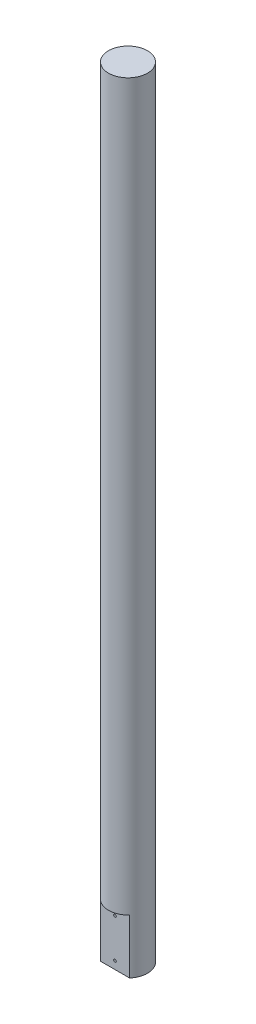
ISO-10303-21;
HEADER;
FILE_DESCRIPTION(('STEP AP214'),'2;1');
FILE_NAME('part.step','',(''),(''),'','','');
FILE_SCHEMA(('AUTOMOTIVE_DESIGN { 1 0 10303 214 1 1 1 1 }'));
ENDSEC;
DATA;
#1=APPLICATION_CONTEXT('core data for automotive mechanical design processes');
#2=APPLICATION_PROTOCOL_DEFINITION('international standard','automotive_design',2000,#1);
#3=PRODUCT_CONTEXT('',#1,'mechanical');
#4=PRODUCT('Part','Part','',(#3));
#5=PRODUCT_RELATED_PRODUCT_CATEGORY('part','',(#4));
#6=PRODUCT_DEFINITION_FORMATION('','',#4);
#7=PRODUCT_DEFINITION_CONTEXT('part definition',#1,'design');
#8=PRODUCT_DEFINITION('design','',#6,#7);
#9=PRODUCT_DEFINITION_SHAPE('','',#8);
#10=(LENGTH_UNIT() NAMED_UNIT(*) SI_UNIT(.MILLI.,.METRE.));
#11=(NAMED_UNIT(*) PLANE_ANGLE_UNIT() SI_UNIT($,.RADIAN.));
#12=(NAMED_UNIT(*) SI_UNIT($,.STERADIAN.) SOLID_ANGLE_UNIT());
#13=UNCERTAINTY_MEASURE_WITH_UNIT(LENGTH_MEASURE(1.E-05),#10,'distance_accuracy_value','');
#14=(GEOMETRIC_REPRESENTATION_CONTEXT(3) GLOBAL_UNCERTAINTY_ASSIGNED_CONTEXT((#13)) GLOBAL_UNIT_ASSIGNED_CONTEXT((#10,
#11,#12)) REPRESENTATION_CONTEXT('',''));
#15=CARTESIAN_POINT('',(0.,0.,0.));
#16=DIRECTION('',(0.,0.,1.));
#17=DIRECTION('',(1.,0.,0.));
#18=AXIS2_PLACEMENT_3D('',#15,#16,#17);
#19=CARTESIAN_POINT('',(0.,300.,0.));
#20=DIRECTION('',(0.,-1.,0.));
#21=DIRECTION('',(0.,0.,-1.));
#22=AXIS2_PLACEMENT_3D('',#19,#20,#21);
#23=CYLINDRICAL_SURFACE('',#22,7.5);
#24=CARTESIAN_POINT('',(0.,300.,0.));
#25=DIRECTION('',(0.,1.,0.));
#26=DIRECTION('',(0.,0.,1.));
#27=AXIS2_PLACEMENT_3D('',#24,#25,#26);
#28=CIRCLE('',#27,7.5);
#29=CARTESIAN_POINT('',(0.,300.,7.5));
#30=VERTEX_POINT('',#29);
#31=EDGE_CURVE('E66',#30,#30,#28,.T.);
#32=ORIENTED_EDGE('',*,*,#31,.F.);
#33=EDGE_LOOP('',(#32));
#34=FACE_BOUND('',#33,.T.);
#35=CARTESIAN_POINT('',(0.,21.,0.));
#36=DIRECTION('',(0.,1.,0.));
#37=DIRECTION('',(0.,0.,1.));
#38=AXIS2_PLACEMENT_3D('',#35,#36,#37);
#39=CIRCLE('',#38,7.5);
#40=CARTESIAN_POINT('',(-5.59016994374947,21.,5.));
#41=VERTEX_POINT('',#40);
#42=CARTESIAN_POINT('',(5.59016994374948,21.,5.));
#43=VERTEX_POINT('',#42);
#44=EDGE_CURVE('E11',#41,#43,#39,.T.);
#45=ORIENTED_EDGE('',*,*,#44,.T.);
#46=DIRECTION('',(0.,-1.,0.));
#47=VECTOR('',#46,1.);
#48=CARTESIAN_POINT('',(5.59016994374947,300.,5.));
#49=LINE('',#48,#47);
#50=CARTESIAN_POINT('',(5.59016994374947,0.,5.));
#51=VERTEX_POINT('',#50);
#52=EDGE_CURVE('E55',#43,#51,#49,.T.);
#53=ORIENTED_EDGE('',*,*,#52,.T.);
#54=CARTESIAN_POINT('',(0.,0.,0.));
#55=DIRECTION('',(0.,1.,0.));
#56=DIRECTION('',(0.,0.,1.));
#57=AXIS2_PLACEMENT_3D('',#54,#55,#56);
#58=CIRCLE('',#57,7.5);
#59=CARTESIAN_POINT('',(-5.59016994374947,0.,5.));
#60=VERTEX_POINT('',#59);
#61=EDGE_CURVE('E60',#51,#60,#58,.T.);
#62=ORIENTED_EDGE('',*,*,#61,.T.);
#63=DIRECTION('',(0.,-1.,0.));
#64=VECTOR('',#63,1.);
#65=CARTESIAN_POINT('',(-5.59016994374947,300.,5.));
#66=LINE('',#65,#64);
#67=EDGE_CURVE('E40',#60,#41,#66,.F.);
#68=ORIENTED_EDGE('',*,*,#67,.T.);
#69=EDGE_LOOP('',(#45,#53,#62,#68));
#70=FACE_BOUND('',#69,.T.);
#71=ADVANCED_FACE('F26',(#34,#70),#23,.T.);
#72=CARTESIAN_POINT('',(0.,300.,0.));
#73=DIRECTION('',(0.,1.,0.));
#74=DIRECTION('',(0.,0.,1.));
#75=AXIS2_PLACEMENT_3D('',#72,#73,#74);
#76=PLANE('',#75);
#77=ORIENTED_EDGE('',*,*,#31,.T.);
#78=EDGE_LOOP('',(#77));
#79=FACE_BOUND('',#78,.T.);
#80=ADVANCED_FACE('F71',(#79),#76,.T.);
#81=CARTESIAN_POINT('',(0.,0.,0.));
#82=DIRECTION('',(0.,1.,0.));
#83=DIRECTION('',(0.,0.,1.));
#84=AXIS2_PLACEMENT_3D('',#81,#82,#83);
#85=PLANE('',#84);
#86=ORIENTED_EDGE('',*,*,#61,.F.);
#87=DIRECTION('',(-1.,0.,0.));
#88=VECTOR('',#87,1.);
#89=CARTESIAN_POINT('',(0.,0.,5.));
#90=LINE('',#89,#88);
#91=EDGE_CURVE('E33',#51,#60,#90,.T.);
#92=ORIENTED_EDGE('',*,*,#91,.T.);
#93=EDGE_LOOP('',(#86,#92));
#94=FACE_BOUND('',#93,.T.);
#95=ADVANCED_FACE('F69',(#94),#85,.F.);
#96=CARTESIAN_POINT('',(-10.,21.,8.22039462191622));
#97=DIRECTION('',(0.,1.,0.));
#98=DIRECTION('',(0.,0.,1.));
#99=AXIS2_PLACEMENT_3D('',#96,#97,#98);
#100=PLANE('',#99);
#101=DIRECTION('',(1.,0.,0.));
#102=VECTOR('',#101,1.);
#103=CARTESIAN_POINT('',(-10.,21.,5.));
#104=LINE('',#103,#102);
#105=EDGE_CURVE('E52',#41,#43,#104,.T.);
#106=ORIENTED_EDGE('',*,*,#105,.T.);
#107=ORIENTED_EDGE('',*,*,#44,.F.);
#108=EDGE_LOOP('',(#106,#107));
#109=FACE_BOUND('',#108,.T.);
#110=ADVANCED_FACE('F51',(#109),#100,.F.);
#111=CARTESIAN_POINT('',(-10.,21.,5.));
#112=DIRECTION('',(0.,0.,-1.));
#113=DIRECTION('',(-1.,0.,0.));
#114=AXIS2_PLACEMENT_3D('',#111,#112,#113);
#115=PLANE('',#114);
#116=CARTESIAN_POINT('',(0.,18.,5.));
#117=DIRECTION('',(0.,0.,1.));
#118=DIRECTION('',(1.,0.,0.));
#119=AXIS2_PLACEMENT_3D('',#116,#117,#118);
#120=CIRCLE('',#119,0.5);
#121=CARTESIAN_POINT('',(0.5,18.,5.));
#122=VERTEX_POINT('',#121);
#123=EDGE_CURVE('E139',#122,#122,#120,.T.);
#124=ORIENTED_EDGE('',*,*,#123,.F.);
#125=EDGE_LOOP('',(#124));
#126=FACE_BOUND('',#125,.T.);
#127=CARTESIAN_POINT('',(0.,3.,5.));
#128=DIRECTION('',(0.,0.,1.));
#129=DIRECTION('',(1.,0.,0.));
#130=AXIS2_PLACEMENT_3D('',#127,#128,#129);
#131=CIRCLE('',#130,0.5);
#132=CARTESIAN_POINT('',(0.499999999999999,3.,5.));
#133=VERTEX_POINT('',#132);
#134=EDGE_CURVE('E138',#133,#133,#131,.T.);
#135=ORIENTED_EDGE('',*,*,#134,.F.);
#136=EDGE_LOOP('',(#135));
#137=FACE_BOUND('',#136,.T.);
#138=ORIENTED_EDGE('',*,*,#105,.F.);
#139=ORIENTED_EDGE('',*,*,#67,.F.);
#140=ORIENTED_EDGE('',*,*,#91,.F.);
#141=ORIENTED_EDGE('',*,*,#52,.F.);
#142=EDGE_LOOP('',(#138,#139,#140,#141));
#143=FACE_BOUND('',#142,.T.);
#144=ADVANCED_FACE('F54',(#126,#137,#143),#115,.F.);
#145=CARTESIAN_POINT('',(0.,3.,4.));
#146=DIRECTION('',(0.,0.,1.));
#147=DIRECTION('',(1.,0.,0.));
#148=AXIS2_PLACEMENT_3D('',#145,#146,#147);
#149=CYLINDRICAL_SURFACE('',#148,0.5);
#150=CARTESIAN_POINT('',(0.,3.,4.));
#151=DIRECTION('',(0.,0.,1.));
#152=DIRECTION('',(1.,0.,0.));
#153=AXIS2_PLACEMENT_3D('',#150,#151,#152);
#154=CIRCLE('',#153,0.5);
#155=CARTESIAN_POINT('',(0.499999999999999,3.,4.));
#156=VERTEX_POINT('',#155);
#157=EDGE_CURVE('E56',#156,#156,#154,.T.);
#158=ORIENTED_EDGE('',*,*,#157,.F.);
#159=EDGE_LOOP('',(#158));
#160=FACE_BOUND('',#159,.T.);
#161=ORIENTED_EDGE('',*,*,#134,.T.);
#162=EDGE_LOOP('',(#161));
#163=FACE_BOUND('',#162,.T.);
#164=ADVANCED_FACE('F102',(#160,#163),#149,.F.);
#165=CARTESIAN_POINT('',(0.,3.,4.));
#166=DIRECTION('',(0.,0.,1.));
#167=DIRECTION('',(1.,0.,0.));
#168=AXIS2_PLACEMENT_3D('',#165,#166,#167);
#169=PLANE('',#168);
#170=ORIENTED_EDGE('',*,*,#157,.T.);
#171=EDGE_LOOP('',(#170));
#172=FACE_BOUND('',#171,.T.);
#173=ADVANCED_FACE('F109',(#172),#169,.T.);
#174=CARTESIAN_POINT('',(0.,18.,4.));
#175=DIRECTION('',(0.,0.,1.));
#176=DIRECTION('',(1.,0.,0.));
#177=AXIS2_PLACEMENT_3D('',#174,#175,#176);
#178=CYLINDRICAL_SURFACE('',#177,0.5);
#179=CARTESIAN_POINT('',(0.,18.,4.));
#180=DIRECTION('',(0.,0.,1.));
#181=DIRECTION('',(1.,0.,0.));
#182=AXIS2_PLACEMENT_3D('',#179,#180,#181);
#183=CIRCLE('',#182,0.5);
#184=CARTESIAN_POINT('',(0.5,18.,4.));
#185=VERTEX_POINT('',#184);
#186=EDGE_CURVE('E137',#185,#185,#183,.T.);
#187=ORIENTED_EDGE('',*,*,#186,.F.);
#188=EDGE_LOOP('',(#187));
#189=FACE_BOUND('',#188,.T.);
#190=ORIENTED_EDGE('',*,*,#123,.T.);
#191=EDGE_LOOP('',(#190));
#192=FACE_BOUND('',#191,.T.);
#193=ADVANCED_FACE('F117',(#189,#192),#178,.F.);
#194=CARTESIAN_POINT('',(0.,18.,4.));
#195=DIRECTION('',(0.,0.,1.));
#196=DIRECTION('',(1.,0.,0.));
#197=AXIS2_PLACEMENT_3D('',#194,#195,#196);
#198=PLANE('',#197);
#199=ORIENTED_EDGE('',*,*,#186,.T.);
#200=EDGE_LOOP('',(#199));
#201=FACE_BOUND('',#200,.T.);
#202=ADVANCED_FACE('F125',(#201),#198,.T.);
#203=CLOSED_SHELL('',(#71,#80,#95,#110,#144,#164,#173,#193,#202));
#204=MANIFOLD_SOLID_BREP('B2',#203);
#205=ADVANCED_BREP_SHAPE_REPRESENTATION('',(#18,#204),#14);
#206=SHAPE_DEFINITION_REPRESENTATION(#9,#205);
ENDSEC;
END-ISO-10303-21;
